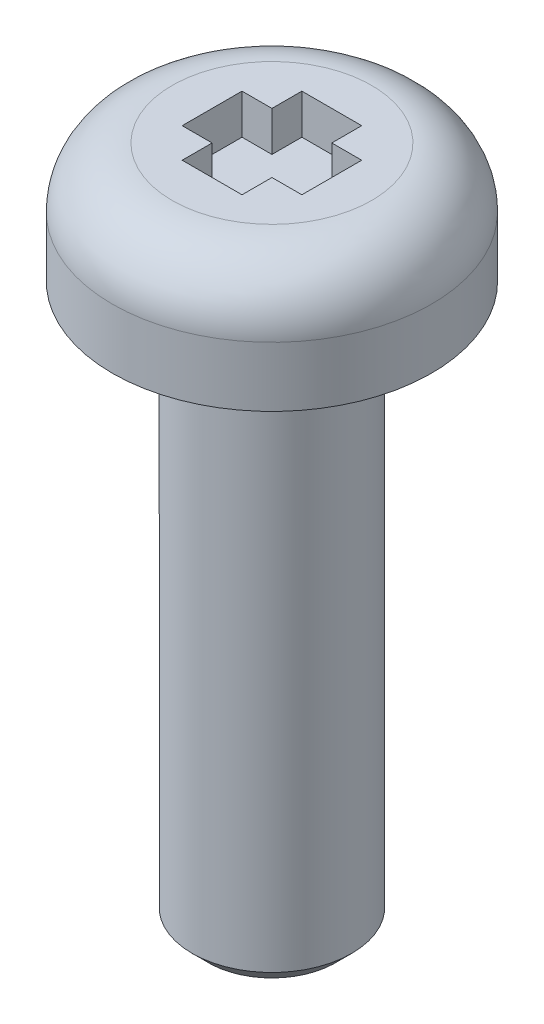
ISO-10303-21;
HEADER;
FILE_DESCRIPTION(('STEP AP214'),'2;1');
FILE_NAME('part.step','',(''),(''),'','','');
FILE_SCHEMA(('AUTOMOTIVE_DESIGN { 1 0 10303 214 1 1 1 1 }'));
ENDSEC;
DATA;
#1=APPLICATION_CONTEXT('core data for automotive mechanical design processes');
#2=APPLICATION_PROTOCOL_DEFINITION('international standard','automotive_design',2000,#1);
#3=PRODUCT_CONTEXT('',#1,'mechanical');
#4=PRODUCT('Part','Part','',(#3));
#5=PRODUCT_RELATED_PRODUCT_CATEGORY('part','',(#4));
#6=PRODUCT_DEFINITION_FORMATION('','',#4);
#7=PRODUCT_DEFINITION_CONTEXT('part definition',#1,'design');
#8=PRODUCT_DEFINITION('design','',#6,#7);
#9=PRODUCT_DEFINITION_SHAPE('','',#8);
#10=(LENGTH_UNIT() NAMED_UNIT(*) SI_UNIT(.MILLI.,.METRE.));
#11=(NAMED_UNIT(*) PLANE_ANGLE_UNIT() SI_UNIT($,.RADIAN.));
#12=(NAMED_UNIT(*) SI_UNIT($,.STERADIAN.) SOLID_ANGLE_UNIT());
#13=UNCERTAINTY_MEASURE_WITH_UNIT(LENGTH_MEASURE(1.E-05),#10,'distance_accuracy_value','');
#14=(GEOMETRIC_REPRESENTATION_CONTEXT(3) GLOBAL_UNCERTAINTY_ASSIGNED_CONTEXT((#13)) GLOBAL_UNIT_ASSIGNED_CONTEXT((#10,
#11,#12)) REPRESENTATION_CONTEXT('',''));
#15=CARTESIAN_POINT('',(0.,0.,0.));
#16=DIRECTION('',(0.,0.,1.));
#17=DIRECTION('',(1.,0.,0.));
#18=AXIS2_PLACEMENT_3D('',#15,#16,#17);
#19=CARTESIAN_POINT('',(4.,0.,0.));
#20=DIRECTION('',(0.,1.,0.));
#21=DIRECTION('',(0.,0.,1.));
#22=AXIS2_PLACEMENT_3D('',#19,#20,#21);
#23=PLANE('',#22);
#24=CARTESIAN_POINT('',(0.,0.,0.));
#25=DIRECTION('',(0.,1.,0.));
#26=DIRECTION('',(0.,0.,1.));
#27=AXIS2_PLACEMENT_3D('',#24,#25,#26);
#28=CIRCLE('',#27,2.4572);
#29=CARTESIAN_POINT('',(0.,0.,2.4572));
#30=VERTEX_POINT('',#29);
#31=EDGE_CURVE('E209',#30,#30,#28,.T.);
#32=ORIENTED_EDGE('',*,*,#31,.T.);
#33=EDGE_LOOP('',(#32));
#34=FACE_BOUND('',#33,.T.);
#35=CARTESIAN_POINT('',(0.,0.,0.));
#36=DIRECTION('',(0.,1.,0.));
#37=DIRECTION('',(0.,0.,1.));
#38=AXIS2_PLACEMENT_3D('',#35,#36,#37);
#39=CIRCLE('',#38,4.);
#40=CARTESIAN_POINT('',(0.,0.,4.));
#41=VERTEX_POINT('',#40);
#42=EDGE_CURVE('E203',#41,#41,#39,.T.);
#43=ORIENTED_EDGE('',*,*,#42,.F.);
#44=EDGE_LOOP('',(#43));
#45=FACE_BOUND('',#44,.T.);
#46=ADVANCED_FACE('F31',(#34,#45),#23,.F.);
#47=CARTESIAN_POINT('',(0.750000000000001,2.,1.5));
#48=DIRECTION('',(1.,0.,0.));
#49=DIRECTION('',(0.,0.,-1.));
#50=AXIS2_PLACEMENT_3D('',#47,#48,#49);
#51=PLANE('',#50);
#52=DIRECTION('',(0.,1.,0.));
#53=VECTOR('',#52,1.);
#54=CARTESIAN_POINT('',(0.75,2.,0.749999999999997));
#55=LINE('',#54,#53);
#56=CARTESIAN_POINT('',(0.750000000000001,2.,0.749999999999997));
#57=VERTEX_POINT('',#56);
#58=CARTESIAN_POINT('',(0.75,3.,0.749999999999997));
#59=VERTEX_POINT('',#58);
#60=EDGE_CURVE('E153',#57,#59,#55,.T.);
#61=ORIENTED_EDGE('',*,*,#60,.F.);
#62=DIRECTION('',(0.,0.,-1.));
#63=VECTOR('',#62,1.);
#64=CARTESIAN_POINT('',(0.750000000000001,2.,1.5));
#65=LINE('',#64,#63);
#66=CARTESIAN_POINT('',(0.750000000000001,2.,1.5));
#67=VERTEX_POINT('',#66);
#68=EDGE_CURVE('E162',#67,#57,#65,.T.);
#69=ORIENTED_EDGE('',*,*,#68,.F.);
#70=DIRECTION('',(0.,1.,0.));
#71=VECTOR('',#70,1.);
#72=CARTESIAN_POINT('',(0.750000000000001,2.,1.5));
#73=LINE('',#72,#71);
#74=CARTESIAN_POINT('',(0.750000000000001,3.,1.5));
#75=VERTEX_POINT('',#74);
#76=EDGE_CURVE('E188',#67,#75,#73,.T.);
#77=ORIENTED_EDGE('',*,*,#76,.T.);
#78=DIRECTION('',(0.,0.,-1.));
#79=VECTOR('',#78,1.);
#80=CARTESIAN_POINT('',(0.750000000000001,3.,1.5));
#81=LINE('',#80,#79);
#82=EDGE_CURVE('E175',#75,#59,#81,.T.);
#83=ORIENTED_EDGE('',*,*,#82,.T.);
#84=EDGE_LOOP('',(#61,#69,#77,#83));
#85=FACE_BOUND('',#84,.T.);
#86=ADVANCED_FACE('F225',(#85),#51,.F.);
#87=CARTESIAN_POINT('',(-0.749999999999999,2.,1.5));
#88=DIRECTION('',(1.,0.,0.));
#89=DIRECTION('',(0.,0.,-1.));
#90=AXIS2_PLACEMENT_3D('',#87,#88,#89);
#91=PLANE('',#90);
#92=DIRECTION('',(0.,0.,-1.));
#93=VECTOR('',#92,1.);
#94=CARTESIAN_POINT('',(-0.749999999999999,2.,1.5));
#95=LINE('',#94,#93);
#96=CARTESIAN_POINT('',(-0.749999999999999,2.,1.5));
#97=VERTEX_POINT('',#96);
#98=CARTESIAN_POINT('',(-0.75,2.,0.75));
#99=VERTEX_POINT('',#98);
#100=EDGE_CURVE('E169',#97,#99,#95,.T.);
#101=ORIENTED_EDGE('',*,*,#100,.T.);
#102=DIRECTION('',(0.,1.,0.));
#103=VECTOR('',#102,1.);
#104=CARTESIAN_POINT('',(-0.75,2.,0.750000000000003));
#105=LINE('',#104,#103);
#106=CARTESIAN_POINT('',(-0.75,3.,0.750000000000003));
#107=VERTEX_POINT('',#106);
#108=EDGE_CURVE('E150',#99,#107,#105,.T.);
#109=ORIENTED_EDGE('',*,*,#108,.T.);
#110=DIRECTION('',(0.,0.,-1.));
#111=VECTOR('',#110,1.);
#112=CARTESIAN_POINT('',(-0.749999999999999,3.,1.5));
#113=LINE('',#112,#111);
#114=CARTESIAN_POINT('',(-0.749999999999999,3.,1.5));
#115=VERTEX_POINT('',#114);
#116=EDGE_CURVE('E182',#115,#107,#113,.T.);
#117=ORIENTED_EDGE('',*,*,#116,.F.);
#118=DIRECTION('',(0.,1.,0.));
#119=VECTOR('',#118,1.);
#120=CARTESIAN_POINT('',(-0.749999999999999,2.,1.5));
#121=LINE('',#120,#119);
#122=EDGE_CURVE('E191',#97,#115,#121,.T.);
#123=ORIENTED_EDGE('',*,*,#122,.F.);
#124=EDGE_LOOP('',(#101,#109,#117,#123));
#125=FACE_BOUND('',#124,.T.);
#126=ADVANCED_FACE('F231',(#125),#91,.T.);
#127=CARTESIAN_POINT('',(0.,11.592517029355,0.));
#128=DIRECTION('',(0.,1.,0.));
#129=DIRECTION('',(0.,0.,1.));
#130=AXIS2_PLACEMENT_3D('',#127,#128,#129);
#131=CYLINDRICAL_SURFACE('',#130,4.);
#132=CARTESIAN_POINT('',(0.,1.5,0.));
#133=DIRECTION('',(0.,1.,0.));
#134=DIRECTION('',(0.,0.,1.));
#135=AXIS2_PLACEMENT_3D('',#132,#133,#134);
#136=CIRCLE('',#135,4.);
#137=CARTESIAN_POINT('',(0.,1.5,4.));
#138=VERTEX_POINT('',#137);
#139=EDGE_CURVE('E200',#138,#138,#136,.T.);
#140=ORIENTED_EDGE('',*,*,#139,.F.);
#141=EDGE_LOOP('',(#140));
#142=FACE_BOUND('',#141,.T.);
#143=ORIENTED_EDGE('',*,*,#42,.T.);
#144=EDGE_LOOP('',(#143));
#145=FACE_BOUND('',#144,.T.);
#146=ADVANCED_FACE('F237',(#142,#145),#131,.T.);
#147=CARTESIAN_POINT('',(0.,1.5,0.));
#148=DIRECTION('',(0.,1.,0.));
#149=DIRECTION('',(0.,0.,1.));
#150=AXIS2_PLACEMENT_3D('',#147,#148,#149);
#151=TOROIDAL_SURFACE('',#150,2.5,1.5);
#152=CARTESIAN_POINT('',(0.,3.,0.));
#153=DIRECTION('',(0.,1.,0.));
#154=DIRECTION('',(0.,0.,1.));
#155=AXIS2_PLACEMENT_3D('',#152,#153,#154);
#156=CIRCLE('',#155,2.5);
#157=CARTESIAN_POINT('',(0.,3.,2.5));
#158=VERTEX_POINT('',#157);
#159=EDGE_CURVE('E190',#158,#158,#156,.T.);
#160=ORIENTED_EDGE('',*,*,#159,.F.);
#161=EDGE_LOOP('',(#160));
#162=FACE_BOUND('',#161,.T.);
#163=ORIENTED_EDGE('',*,*,#139,.T.);
#164=EDGE_LOOP('',(#163));
#165=FACE_BOUND('',#164,.T.);
#166=ADVANCED_FACE('F240',(#162,#165),#151,.T.);
#167=CARTESIAN_POINT('',(0.,3.,0.));
#168=DIRECTION('',(0.,-1.,0.));
#169=DIRECTION('',(0.,0.,-1.));
#170=AXIS2_PLACEMENT_3D('',#167,#168,#169);
#171=PLANE('',#170);
#172=CARTESIAN_POINT('',(0.75,3.,-0.750000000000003));
#173=VERTEX_POINT('',#172);
#174=CARTESIAN_POINT('',(0.75,3.,-1.5));
#175=VERTEX_POINT('',#174);
#176=EDGE_CURVE('E161',#173,#175,#81,.T.);
#177=ORIENTED_EDGE('',*,*,#176,.F.);
#178=DIRECTION('',(-1.,0.,0.));
#179=VECTOR('',#178,1.);
#180=CARTESIAN_POINT('',(1.5,3.,-0.750000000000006));
#181=LINE('',#180,#179);
#182=CARTESIAN_POINT('',(1.5,3.,-0.750000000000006));
#183=VERTEX_POINT('',#182);
#184=EDGE_CURVE('E438',#183,#173,#181,.T.);
#185=ORIENTED_EDGE('',*,*,#184,.F.);
#186=DIRECTION('',(0.,0.,1.));
#187=VECTOR('',#186,1.);
#188=CARTESIAN_POINT('',(1.5,3.,-0.750000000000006));
#189=LINE('',#188,#187);
#190=CARTESIAN_POINT('',(1.5,3.,0.749999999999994));
#191=VERTEX_POINT('',#190);
#192=EDGE_CURVE('E128',#183,#191,#189,.T.);
#193=ORIENTED_EDGE('',*,*,#192,.T.);
#194=DIRECTION('',(-1.,0.,0.));
#195=VECTOR('',#194,1.);
#196=CARTESIAN_POINT('',(1.5,3.,0.749999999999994));
#197=LINE('',#196,#195);
#198=EDGE_CURVE('E423',#191,#59,#197,.T.);
#199=ORIENTED_EDGE('',*,*,#198,.T.);
#200=ORIENTED_EDGE('',*,*,#82,.F.);
#201=DIRECTION('',(-1.,0.,0.));
#202=VECTOR('',#201,1.);
#203=CARTESIAN_POINT('',(0.750000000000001,3.,1.5));
#204=LINE('',#203,#202);
#205=EDGE_CURVE('E185',#75,#115,#204,.T.);
#206=ORIENTED_EDGE('',*,*,#205,.T.);
#207=ORIENTED_EDGE('',*,*,#116,.T.);
#208=CARTESIAN_POINT('',(-1.5,3.,0.750000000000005));
#209=VERTEX_POINT('',#208);
#210=EDGE_CURVE('E429',#107,#209,#197,.T.);
#211=ORIENTED_EDGE('',*,*,#210,.T.);
#212=DIRECTION('',(0.,0.,-1.));
#213=VECTOR('',#212,1.);
#214=CARTESIAN_POINT('',(-1.5,3.,0.750000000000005));
#215=LINE('',#214,#213);
#216=CARTESIAN_POINT('',(-1.5,3.,-0.749999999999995));
#217=VERTEX_POINT('',#216);
#218=EDGE_CURVE('E433',#209,#217,#215,.T.);
#219=ORIENTED_EDGE('',*,*,#218,.T.);
#220=CARTESIAN_POINT('',(-0.75,3.,-0.749999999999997));
#221=VERTEX_POINT('',#220);
#222=EDGE_CURVE('E141',#221,#217,#181,.T.);
#223=ORIENTED_EDGE('',*,*,#222,.F.);
#224=CARTESIAN_POINT('',(-0.75,3.,-1.5));
#225=VERTEX_POINT('',#224);
#226=EDGE_CURVE('E181',#221,#225,#113,.T.);
#227=ORIENTED_EDGE('',*,*,#226,.T.);
#228=DIRECTION('',(1.,0.,0.));
#229=VECTOR('',#228,1.);
#230=CARTESIAN_POINT('',(-0.75,3.,-1.5));
#231=LINE('',#230,#229);
#232=EDGE_CURVE('E178',#225,#175,#231,.T.);
#233=ORIENTED_EDGE('',*,*,#232,.T.);
#234=EDGE_LOOP('',(#177,#185,#193,#199,#200,#206,#207,#211,#219,#223,#227,#233));
#235=FACE_BOUND('',#234,.T.);
#236=ORIENTED_EDGE('',*,*,#159,.T.);
#237=EDGE_LOOP('',(#236));
#238=FACE_BOUND('',#237,.T.);
#239=ADVANCED_FACE('F244',(#235,#238),#171,.F.);
#240=CARTESIAN_POINT('',(0.75,2.,-0.75));
#241=VERTEX_POINT('',#240);
#242=CARTESIAN_POINT('',(0.75,2.,-1.5));
#243=VERTEX_POINT('',#242);
#244=EDGE_CURVE('E166',#241,#243,#65,.T.);
#245=ORIENTED_EDGE('',*,*,#244,.F.);
#246=DIRECTION('',(0.,1.,0.));
#247=VECTOR('',#246,1.);
#248=CARTESIAN_POINT('',(0.75,2.,-0.750000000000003));
#249=LINE('',#248,#247);
#250=EDGE_CURVE('E158',#241,#173,#249,.T.);
#251=ORIENTED_EDGE('',*,*,#250,.T.);
#252=ORIENTED_EDGE('',*,*,#176,.T.);
#253=DIRECTION('',(0.,1.,0.));
#254=VECTOR('',#253,1.);
#255=CARTESIAN_POINT('',(0.75,2.,-1.5));
#256=LINE('',#255,#254);
#257=EDGE_CURVE('E174',#243,#175,#256,.T.);
#258=ORIENTED_EDGE('',*,*,#257,.F.);
#259=EDGE_LOOP('',(#245,#251,#252,#258));
#260=FACE_BOUND('',#259,.T.);
#261=ADVANCED_FACE('F234',(#260),#51,.F.);
#262=CARTESIAN_POINT('',(0.750000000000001,2.,1.5));
#263=DIRECTION('',(0.,0.,-1.));
#264=DIRECTION('',(-1.,0.,0.));
#265=AXIS2_PLACEMENT_3D('',#262,#263,#264);
#266=PLANE('',#265);
#267=ORIENTED_EDGE('',*,*,#205,.F.);
#268=ORIENTED_EDGE('',*,*,#76,.F.);
#269=DIRECTION('',(-1.,0.,0.));
#270=VECTOR('',#269,1.);
#271=CARTESIAN_POINT('',(0.750000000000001,2.,1.5));
#272=LINE('',#271,#270);
#273=EDGE_CURVE('E172',#67,#97,#272,.T.);
#274=ORIENTED_EDGE('',*,*,#273,.T.);
#275=ORIENTED_EDGE('',*,*,#122,.T.);
#276=EDGE_LOOP('',(#267,#268,#274,#275));
#277=FACE_BOUND('',#276,.T.);
#278=ADVANCED_FACE('F250',(#277),#266,.T.);
#279=DIRECTION('',(0.,1.,0.));
#280=VECTOR('',#279,1.);
#281=CARTESIAN_POINT('',(-0.75,2.,-0.749999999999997));
#282=LINE('',#281,#280);
#283=CARTESIAN_POINT('',(-0.75,2.,-0.749999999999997));
#284=VERTEX_POINT('',#283);
#285=EDGE_CURVE('E156',#284,#221,#282,.T.);
#286=ORIENTED_EDGE('',*,*,#285,.F.);
#287=CARTESIAN_POINT('',(-0.75,2.,-1.5));
#288=VERTEX_POINT('',#287);
#289=EDGE_CURVE('E124',#284,#288,#95,.T.);
#290=ORIENTED_EDGE('',*,*,#289,.T.);
#291=DIRECTION('',(0.,1.,0.));
#292=VECTOR('',#291,1.);
#293=CARTESIAN_POINT('',(-0.75,2.,-1.5));
#294=LINE('',#293,#292);
#295=EDGE_CURVE('E193',#288,#225,#294,.T.);
#296=ORIENTED_EDGE('',*,*,#295,.T.);
#297=ORIENTED_EDGE('',*,*,#226,.F.);
#298=EDGE_LOOP('',(#286,#290,#296,#297));
#299=FACE_BOUND('',#298,.T.);
#300=ADVANCED_FACE('F255',(#299),#91,.T.);
#301=CARTESIAN_POINT('',(-0.75,2.,-1.5));
#302=DIRECTION('',(0.,0.,1.));
#303=DIRECTION('',(1.,0.,0.));
#304=AXIS2_PLACEMENT_3D('',#301,#302,#303);
#305=PLANE('',#304);
#306=ORIENTED_EDGE('',*,*,#232,.F.);
#307=ORIENTED_EDGE('',*,*,#295,.F.);
#308=DIRECTION('',(1.,0.,0.));
#309=VECTOR('',#308,1.);
#310=CARTESIAN_POINT('',(-0.75,2.,-1.5));
#311=LINE('',#310,#309);
#312=EDGE_CURVE('E165',#288,#243,#311,.T.);
#313=ORIENTED_EDGE('',*,*,#312,.T.);
#314=ORIENTED_EDGE('',*,*,#257,.T.);
#315=EDGE_LOOP('',(#306,#307,#313,#314));
#316=FACE_BOUND('',#315,.T.);
#317=ADVANCED_FACE('F252',(#316),#305,.T.);
#318=CARTESIAN_POINT('',(0.75,2.,-1.5));
#319=DIRECTION('',(0.,-1.,0.));
#320=DIRECTION('',(0.,0.,-1.));
#321=AXIS2_PLACEMENT_3D('',#318,#319,#320);
#322=PLANE('',#321);
#323=ORIENTED_EDGE('',*,*,#289,.F.);
#324=DIRECTION('',(-1.,0.,0.));
#325=VECTOR('',#324,1.);
#326=CARTESIAN_POINT('',(1.5,2.,-0.750000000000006));
#327=LINE('',#326,#325);
#328=CARTESIAN_POINT('',(-1.5,2.,-0.749999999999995));
#329=VERTEX_POINT('',#328);
#330=EDGE_CURVE('E119',#284,#329,#327,.T.);
#331=ORIENTED_EDGE('',*,*,#330,.T.);
#332=DIRECTION('',(0.,0.,-1.));
#333=VECTOR('',#332,1.);
#334=CARTESIAN_POINT('',(-1.5,2.,0.750000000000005));
#335=LINE('',#334,#333);
#336=CARTESIAN_POINT('',(-1.5,2.,0.750000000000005));
#337=VERTEX_POINT('',#336);
#338=EDGE_CURVE('E122',#337,#329,#335,.T.);
#339=ORIENTED_EDGE('',*,*,#338,.F.);
#340=DIRECTION('',(-1.,0.,0.));
#341=VECTOR('',#340,1.);
#342=CARTESIAN_POINT('',(1.5,2.,0.749999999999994));
#343=LINE('',#342,#341);
#344=EDGE_CURVE('E46',#99,#337,#343,.T.);
#345=ORIENTED_EDGE('',*,*,#344,.F.);
#346=ORIENTED_EDGE('',*,*,#100,.F.);
#347=ORIENTED_EDGE('',*,*,#273,.F.);
#348=ORIENTED_EDGE('',*,*,#68,.T.);
#349=CARTESIAN_POINT('',(1.5,2.,0.749999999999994));
#350=VERTEX_POINT('',#349);
#351=EDGE_CURVE('E146',#350,#57,#343,.T.);
#352=ORIENTED_EDGE('',*,*,#351,.F.);
#353=DIRECTION('',(0.,0.,1.));
#354=VECTOR('',#353,1.);
#355=CARTESIAN_POINT('',(1.5,2.,-0.750000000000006));
#356=LINE('',#355,#354);
#357=CARTESIAN_POINT('',(1.5,2.,-0.750000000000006));
#358=VERTEX_POINT('',#357);
#359=EDGE_CURVE('E142',#358,#350,#356,.T.);
#360=ORIENTED_EDGE('',*,*,#359,.F.);
#361=EDGE_CURVE('E53',#358,#241,#327,.T.);
#362=ORIENTED_EDGE('',*,*,#361,.T.);
#363=ORIENTED_EDGE('',*,*,#244,.T.);
#364=ORIENTED_EDGE('',*,*,#312,.F.);
#365=EDGE_LOOP('',(#323,#331,#339,#345,#346,#347,#348,#352,#360,#362,#363,#364));
#366=FACE_BOUND('',#365,.T.);
#367=ADVANCED_FACE('F121',(#366),#322,.F.);
#368=CARTESIAN_POINT('',(1.5,2.,0.749999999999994));
#369=DIRECTION('',(0.,0.,-1.));
#370=DIRECTION('',(-1.,0.,0.));
#371=AXIS2_PLACEMENT_3D('',#368,#369,#370);
#372=PLANE('',#371);
#373=ORIENTED_EDGE('',*,*,#344,.T.);
#374=DIRECTION('',(0.,1.,0.));
#375=VECTOR('',#374,1.);
#376=CARTESIAN_POINT('',(-1.5,2.,0.750000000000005));
#377=LINE('',#376,#375);
#378=EDGE_CURVE('E137',#337,#209,#377,.T.);
#379=ORIENTED_EDGE('',*,*,#378,.T.);
#380=ORIENTED_EDGE('',*,*,#210,.F.);
#381=ORIENTED_EDGE('',*,*,#108,.F.);
#382=EDGE_LOOP('',(#373,#379,#380,#381));
#383=FACE_BOUND('',#382,.T.);
#384=ADVANCED_FACE('F265',(#383),#372,.T.);
#385=CARTESIAN_POINT('',(1.5,2.,-0.750000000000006));
#386=DIRECTION('',(0.,0.,-1.));
#387=DIRECTION('',(-1.,0.,0.));
#388=AXIS2_PLACEMENT_3D('',#385,#386,#387);
#389=PLANE('',#388);
#390=ORIENTED_EDGE('',*,*,#285,.T.);
#391=ORIENTED_EDGE('',*,*,#222,.T.);
#392=DIRECTION('',(0.,1.,0.));
#393=VECTOR('',#392,1.);
#394=CARTESIAN_POINT('',(-1.5,2.,-0.749999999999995));
#395=LINE('',#394,#393);
#396=EDGE_CURVE('E135',#329,#217,#395,.T.);
#397=ORIENTED_EDGE('',*,*,#396,.F.);
#398=ORIENTED_EDGE('',*,*,#330,.F.);
#399=EDGE_LOOP('',(#390,#391,#397,#398));
#400=FACE_BOUND('',#399,.T.);
#401=ADVANCED_FACE('F139',(#400),#389,.F.);
#402=CARTESIAN_POINT('',(-1.5,2.,0.750000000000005));
#403=DIRECTION('',(1.,0.,0.));
#404=DIRECTION('',(0.,0.,-1.));
#405=AXIS2_PLACEMENT_3D('',#402,#403,#404);
#406=PLANE('',#405);
#407=ORIENTED_EDGE('',*,*,#218,.F.);
#408=ORIENTED_EDGE('',*,*,#378,.F.);
#409=ORIENTED_EDGE('',*,*,#338,.T.);
#410=ORIENTED_EDGE('',*,*,#396,.T.);
#411=EDGE_LOOP('',(#407,#408,#409,#410));
#412=FACE_BOUND('',#411,.T.);
#413=ADVANCED_FACE('F134',(#412),#406,.T.);
#414=ORIENTED_EDGE('',*,*,#361,.F.);
#415=DIRECTION('',(0.,1.,0.));
#416=VECTOR('',#415,1.);
#417=CARTESIAN_POINT('',(1.5,2.,-0.750000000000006));
#418=LINE('',#417,#416);
#419=EDGE_CURVE('E154',#358,#183,#418,.T.);
#420=ORIENTED_EDGE('',*,*,#419,.T.);
#421=ORIENTED_EDGE('',*,*,#184,.T.);
#422=ORIENTED_EDGE('',*,*,#250,.F.);
#423=EDGE_LOOP('',(#414,#420,#421,#422));
#424=FACE_BOUND('',#423,.T.);
#425=ADVANCED_FACE('F268',(#424),#389,.F.);
#426=ORIENTED_EDGE('',*,*,#60,.T.);
#427=ORIENTED_EDGE('',*,*,#198,.F.);
#428=DIRECTION('',(0.,1.,0.));
#429=VECTOR('',#428,1.);
#430=CARTESIAN_POINT('',(1.5,2.,0.749999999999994));
#431=LINE('',#430,#429);
#432=EDGE_CURVE('E144',#350,#191,#431,.T.);
#433=ORIENTED_EDGE('',*,*,#432,.F.);
#434=ORIENTED_EDGE('',*,*,#351,.T.);
#435=EDGE_LOOP('',(#426,#427,#433,#434));
#436=FACE_BOUND('',#435,.T.);
#437=ADVANCED_FACE('F274',(#436),#372,.T.);
#438=CARTESIAN_POINT('',(1.5,2.,-0.750000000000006));
#439=DIRECTION('',(-1.,0.,0.));
#440=DIRECTION('',(0.,0.,1.));
#441=AXIS2_PLACEMENT_3D('',#438,#439,#440);
#442=PLANE('',#441);
#443=ORIENTED_EDGE('',*,*,#192,.F.);
#444=ORIENTED_EDGE('',*,*,#419,.F.);
#445=ORIENTED_EDGE('',*,*,#359,.T.);
#446=ORIENTED_EDGE('',*,*,#432,.T.);
#447=EDGE_LOOP('',(#443,#444,#445,#446));
#448=FACE_BOUND('',#447,.T.);
#449=ADVANCED_FACE('F275',(#448),#442,.T.);
#450=CARTESIAN_POINT('',(0.,-14.,0.));
#451=DIRECTION('',(0.,1.,0.));
#452=DIRECTION('',(0.,0.,1.));
#453=AXIS2_PLACEMENT_3D('',#450,#451,#452);
#454=CYLINDRICAL_SURFACE('',#453,2.);
#455=CARTESIAN_POINT('',(0.,-13.5936,0.));
#456=DIRECTION('',(0.,-1.,0.));
#457=DIRECTION('',(0.,0.,-1.));
#458=AXIS2_PLACEMENT_3D('',#455,#456,#457);
#459=CIRCLE('',#458,2.);
#460=CARTESIAN_POINT('',(0.,-13.5936,-2.));
#461=VERTEX_POINT('',#460);
#462=EDGE_CURVE('E11',#461,#461,#459,.F.);
#463=ORIENTED_EDGE('',*,*,#462,.T.);
#464=EDGE_LOOP('',(#463));
#465=FACE_BOUND('',#464,.T.);
#466=CARTESIAN_POINT('',(0.,-0.4572,0.));
#467=DIRECTION('',(0.,1.,0.));
#468=DIRECTION('',(0.,0.,1.));
#469=AXIS2_PLACEMENT_3D('',#466,#467,#468);
#470=CIRCLE('',#469,2.);
#471=CARTESIAN_POINT('',(0.,-0.4572,2.));
#472=VERTEX_POINT('',#471);
#473=EDGE_CURVE('E206',#472,#472,#470,.F.);
#474=ORIENTED_EDGE('',*,*,#473,.T.);
#475=EDGE_LOOP('',(#474));
#476=FACE_BOUND('',#475,.T.);
#477=ADVANCED_FACE('F278',(#465,#476),#454,.T.);
#478=CARTESIAN_POINT('',(0.,-14.,0.));
#479=DIRECTION('',(0.,-1.,0.));
#480=DIRECTION('',(0.,0.,-1.));
#481=AXIS2_PLACEMENT_3D('',#478,#479,#480);
#482=PLANE('',#481);
#483=CARTESIAN_POINT('',(0.,-14.,0.));
#484=DIRECTION('',(0.,-1.,0.));
#485=DIRECTION('',(0.,0.,-1.));
#486=AXIS2_PLACEMENT_3D('',#483,#484,#485);
#487=CIRCLE('',#486,1.5936);
#488=CARTESIAN_POINT('',(0.,-14.,-1.5936));
#489=VERTEX_POINT('',#488);
#490=EDGE_CURVE('E39',#489,#489,#487,.T.);
#491=ORIENTED_EDGE('',*,*,#490,.T.);
#492=EDGE_LOOP('',(#491));
#493=FACE_BOUND('',#492,.T.);
#494=ADVANCED_FACE('F214',(#493),#482,.T.);
#495=CARTESIAN_POINT('',(0.,-0.4572,0.));
#496=DIRECTION('',(0.,1.,0.));
#497=DIRECTION('',(0.,0.,1.));
#498=AXIS2_PLACEMENT_3D('',#495,#496,#497);
#499=TOROIDAL_SURFACE('',#498,2.4572,0.4572);
#500=ORIENTED_EDGE('',*,*,#31,.F.);
#501=EDGE_LOOP('',(#500));
#502=FACE_BOUND('',#501,.T.);
#503=ORIENTED_EDGE('',*,*,#473,.F.);
#504=EDGE_LOOP('',(#503));
#505=FACE_BOUND('',#504,.T.);
#506=ADVANCED_FACE('F217',(#502,#505),#499,.F.);
#507=CARTESIAN_POINT('',(0.,-14.,0.));
#508=DIRECTION('',(0.,1.,0.));
#509=DIRECTION('',(0.,0.,1.));
#510=AXIS2_PLACEMENT_3D('',#507,#508,#509);
#511=CONICAL_SURFACE('',#510,1.5936,0.785398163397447);
#512=ORIENTED_EDGE('',*,*,#462,.F.);
#513=EDGE_LOOP('',(#512));
#514=FACE_BOUND('',#513,.T.);
#515=ORIENTED_EDGE('',*,*,#490,.F.);
#516=EDGE_LOOP('',(#515));
#517=FACE_BOUND('',#516,.T.);
#518=ADVANCED_FACE('F33',(#514,#517),#511,.T.);
#519=CLOSED_SHELL('',(#46,#86,#126,#146,#166,#239,#261,#278,#300,#317,#367,#384,#401,#413,#425,
#437,#449,#477,#494,#506,#518));
#520=MANIFOLD_SOLID_BREP('B2',#519);
#521=ADVANCED_BREP_SHAPE_REPRESENTATION('',(#18,#520),#14);
#522=SHAPE_DEFINITION_REPRESENTATION(#9,#521);
ENDSEC;
END-ISO-10303-21;
